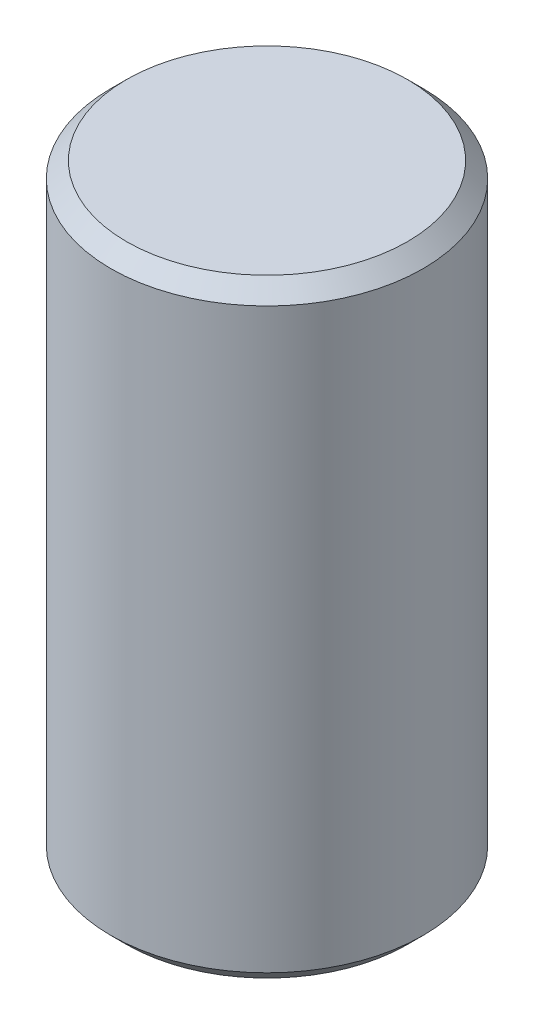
ISO-10303-21;
HEADER;
FILE_DESCRIPTION(('STEP AP214'),'2;1');
FILE_NAME('part.step','',(''),(''),'','','');
FILE_SCHEMA(('AUTOMOTIVE_DESIGN { 1 0 10303 214 1 1 1 1 }'));
ENDSEC;
DATA;
#1=APPLICATION_CONTEXT('core data for automotive mechanical design processes');
#2=APPLICATION_PROTOCOL_DEFINITION('international standard','automotive_design',2000,#1);
#3=PRODUCT_CONTEXT('',#1,'mechanical');
#4=PRODUCT('Part','Part','',(#3));
#5=PRODUCT_RELATED_PRODUCT_CATEGORY('part','',(#4));
#6=PRODUCT_DEFINITION_FORMATION('','',#4);
#7=PRODUCT_DEFINITION_CONTEXT('part definition',#1,'design');
#8=PRODUCT_DEFINITION('design','',#6,#7);
#9=PRODUCT_DEFINITION_SHAPE('','',#8);
#10=(LENGTH_UNIT() NAMED_UNIT(*) SI_UNIT(.MILLI.,.METRE.));
#11=(NAMED_UNIT(*) PLANE_ANGLE_UNIT() SI_UNIT($,.RADIAN.));
#12=(NAMED_UNIT(*) SI_UNIT($,.STERADIAN.) SOLID_ANGLE_UNIT());
#13=UNCERTAINTY_MEASURE_WITH_UNIT(LENGTH_MEASURE(1.E-05),#10,'distance_accuracy_value','');
#14=(GEOMETRIC_REPRESENTATION_CONTEXT(3) GLOBAL_UNCERTAINTY_ASSIGNED_CONTEXT((#13)) GLOBAL_UNIT_ASSIGNED_CONTEXT((#10,
#11,#12)) REPRESENTATION_CONTEXT('',''));
#15=CARTESIAN_POINT('',(0.,0.,0.));
#16=DIRECTION('',(0.,0.,1.));
#17=DIRECTION('',(1.,0.,0.));
#18=AXIS2_PLACEMENT_3D('',#15,#16,#17);
#19=CARTESIAN_POINT('',(0.,9.99999999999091,0.));
#20=DIRECTION('',(0.,-1.,0.));
#21=DIRECTION('',(0.,0.,-1.));
#22=AXIS2_PLACEMENT_3D('',#19,#20,#21);
#23=CONICAL_SURFACE('',#22,1.64999999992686,1.02974425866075);
#24=CARTESIAN_POINT('',(0.,10.9914200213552,1.13686837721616E-10));
#25=VERTEX_POINT('',#24);
#26=VERTEX_LOOP('',#25);
#27=FACE_BOUND('',#26,.T.);
#28=CARTESIAN_POINT('',(0.,10.,0.));
#29=DIRECTION('',(0.,-1.,0.));
#30=DIRECTION('',(0.,0.,-1.));
#31=AXIS2_PLACEMENT_3D('',#28,#29,#30);
#32=CIRCLE('',#31,1.65);
#33=CARTESIAN_POINT('',(0.,10.,-1.65));
#34=VERTEX_POINT('',#33);
#35=EDGE_CURVE('E32',#34,#34,#32,.T.);
#36=ORIENTED_EDGE('',*,*,#35,.T.);
#37=EDGE_LOOP('',(#36));
#38=FACE_BOUND('',#37,.T.);
#39=ADVANCED_FACE('F16',(#27,#38),#23,.F.);
#40=CARTESIAN_POINT('',(0.,11.54099102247,0.));
#41=DIRECTION('',(0.,-1.,0.));
#42=DIRECTION('',(0.,0.,-1.));
#43=AXIS2_PLACEMENT_3D('',#40,#41,#42);
#44=CYLINDRICAL_SURFACE('',#43,1.65);
#45=ORIENTED_EDGE('',*,*,#35,.F.);
#46=EDGE_LOOP('',(#45));
#47=FACE_BOUND('',#46,.T.);
#48=CARTESIAN_POINT('',(0.,0.,0.));
#49=DIRECTION('',(0.,-1.,0.));
#50=DIRECTION('',(0.,0.,-1.));
#51=AXIS2_PLACEMENT_3D('',#48,#49,#50);
#52=CIRCLE('',#51,1.65);
#53=CARTESIAN_POINT('',(0.,0.,-1.65));
#54=VERTEX_POINT('',#53);
#55=EDGE_CURVE('E19',#54,#54,#52,.T.);
#56=ORIENTED_EDGE('',*,*,#55,.T.);
#57=EDGE_LOOP('',(#56));
#58=FACE_BOUND('',#57,.T.);
#59=ADVANCED_FACE('F29',(#47,#58),#44,.F.);
#60=CARTESIAN_POINT('',(0.,0.,0.));
#61=DIRECTION('',(0.,1.,0.));
#62=DIRECTION('',(0.,0.,1.));
#63=AXIS2_PLACEMENT_3D('',#60,#61,#62);
#64=PLANE('',#63);
#65=CARTESIAN_POINT('',(0.,-1.13686837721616E-10,0.));
#66=DIRECTION('',(0.,1.,0.));
#67=DIRECTION('',(0.,0.,1.));
#68=AXIS2_PLACEMENT_3D('',#65,#66,#67);
#69=CIRCLE('',#68,4.50000000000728);
#70=CARTESIAN_POINT('',(0.,-1.13686837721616E-10,4.50000000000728));
#71=VERTEX_POINT('',#70);
#72=EDGE_CURVE('E36',#71,#71,#69,.T.);
#73=ORIENTED_EDGE('',*,*,#72,.F.);
#74=EDGE_LOOP('',(#73));
#75=FACE_BOUND('',#74,.T.);
#76=ORIENTED_EDGE('',*,*,#55,.F.);
#77=EDGE_LOOP('',(#76));
#78=FACE_BOUND('',#77,.T.);
#79=ADVANCED_FACE('F46',(#75,#78),#64,.F.);
#80=CARTESIAN_POINT('',(0.,19.5,0.));
#81=DIRECTION('',(0.,1.,0.));
#82=DIRECTION('',(0.,0.,1.));
#83=AXIS2_PLACEMENT_3D('',#80,#81,#82);
#84=PLANE('',#83);
#85=CARTESIAN_POINT('',(0.,19.4999999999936,0.));
#86=DIRECTION('',(0.,-1.,0.));
#87=DIRECTION('',(0.,0.,-1.));
#88=AXIS2_PLACEMENT_3D('',#85,#86,#87);
#89=CIRCLE('',#88,4.50000000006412);
#90=CARTESIAN_POINT('',(0.,19.4999999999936,-4.50000000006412));
#91=VERTEX_POINT('',#90);
#92=EDGE_CURVE('E39',#91,#91,#89,.T.);
#93=ORIENTED_EDGE('',*,*,#92,.F.);
#94=EDGE_LOOP('',(#93));
#95=FACE_BOUND('',#94,.T.);
#96=ADVANCED_FACE('F49',(#95),#84,.T.);
#97=CARTESIAN_POINT('',(0.,0.499999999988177,0.));
#98=DIRECTION('',(0.,1.,0.));
#99=DIRECTION('',(0.,0.,1.));
#100=AXIS2_PLACEMENT_3D('',#97,#98,#99);
#101=CONICAL_SURFACE('',#100,5.00000000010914,0.785398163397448);
#102=CARTESIAN_POINT('',(0.,0.499999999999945,0.));
#103=DIRECTION('',(0.,1.,0.));
#104=DIRECTION('',(0.,0.,1.));
#105=AXIS2_PLACEMENT_3D('',#102,#103,#104);
#106=CIRCLE('',#105,5.);
#107=CARTESIAN_POINT('',(0.,0.499999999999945,5.));
#108=VERTEX_POINT('',#107);
#109=EDGE_CURVE('E23',#108,#108,#106,.T.);
#110=ORIENTED_EDGE('',*,*,#109,.F.);
#111=EDGE_LOOP('',(#110));
#112=FACE_BOUND('',#111,.T.);
#113=ORIENTED_EDGE('',*,*,#72,.T.);
#114=EDGE_LOOP('',(#113));
#115=FACE_BOUND('',#114,.T.);
#116=ADVANCED_FACE('F44',(#112,#115),#101,.T.);
#117=CARTESIAN_POINT('',(0.,19.0000000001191,0.));
#118=DIRECTION('',(0.,-1.,0.));
#119=DIRECTION('',(0.,0.,-1.));
#120=AXIS2_PLACEMENT_3D('',#117,#118,#119);
#121=CONICAL_SURFACE('',#120,4.99999999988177,0.785398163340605);
#122=CARTESIAN_POINT('',(0.,19.,0.));
#123=DIRECTION('',(0.,1.,0.));
#124=DIRECTION('',(0.,0.,1.));
#125=AXIS2_PLACEMENT_3D('',#122,#123,#124);
#126=CIRCLE('',#125,5.);
#127=CARTESIAN_POINT('',(0.,19.,5.));
#128=VERTEX_POINT('',#127);
#129=EDGE_CURVE('E11',#128,#128,#126,.F.);
#130=ORIENTED_EDGE('',*,*,#129,.F.);
#131=EDGE_LOOP('',(#130));
#132=FACE_BOUND('',#131,.T.);
#133=ORIENTED_EDGE('',*,*,#92,.T.);
#134=EDGE_LOOP('',(#133));
#135=FACE_BOUND('',#134,.T.);
#136=ADVANCED_FACE('F59',(#132,#135),#121,.T.);
#137=CARTESIAN_POINT('',(0.,0.,0.));
#138=DIRECTION('',(0.,1.,0.));
#139=DIRECTION('',(0.,0.,1.));
#140=AXIS2_PLACEMENT_3D('',#137,#138,#139);
#141=CYLINDRICAL_SURFACE('',#140,5.);
#142=ORIENTED_EDGE('',*,*,#129,.T.);
#143=EDGE_LOOP('',(#142));
#144=FACE_BOUND('',#143,.T.);
#145=ORIENTED_EDGE('',*,*,#109,.T.);
#146=EDGE_LOOP('',(#145));
#147=FACE_BOUND('',#146,.T.);
#148=ADVANCED_FACE('F57',(#144,#147),#141,.T.);
#149=CLOSED_SHELL('',(#39,#59,#79,#96,#116,#136,#148));
#150=MANIFOLD_SOLID_BREP('B1',#149);
#151=ADVANCED_BREP_SHAPE_REPRESENTATION('',(#18,#150),#14);
#152=SHAPE_DEFINITION_REPRESENTATION(#9,#151);
ENDSEC;
END-ISO-10303-21;
